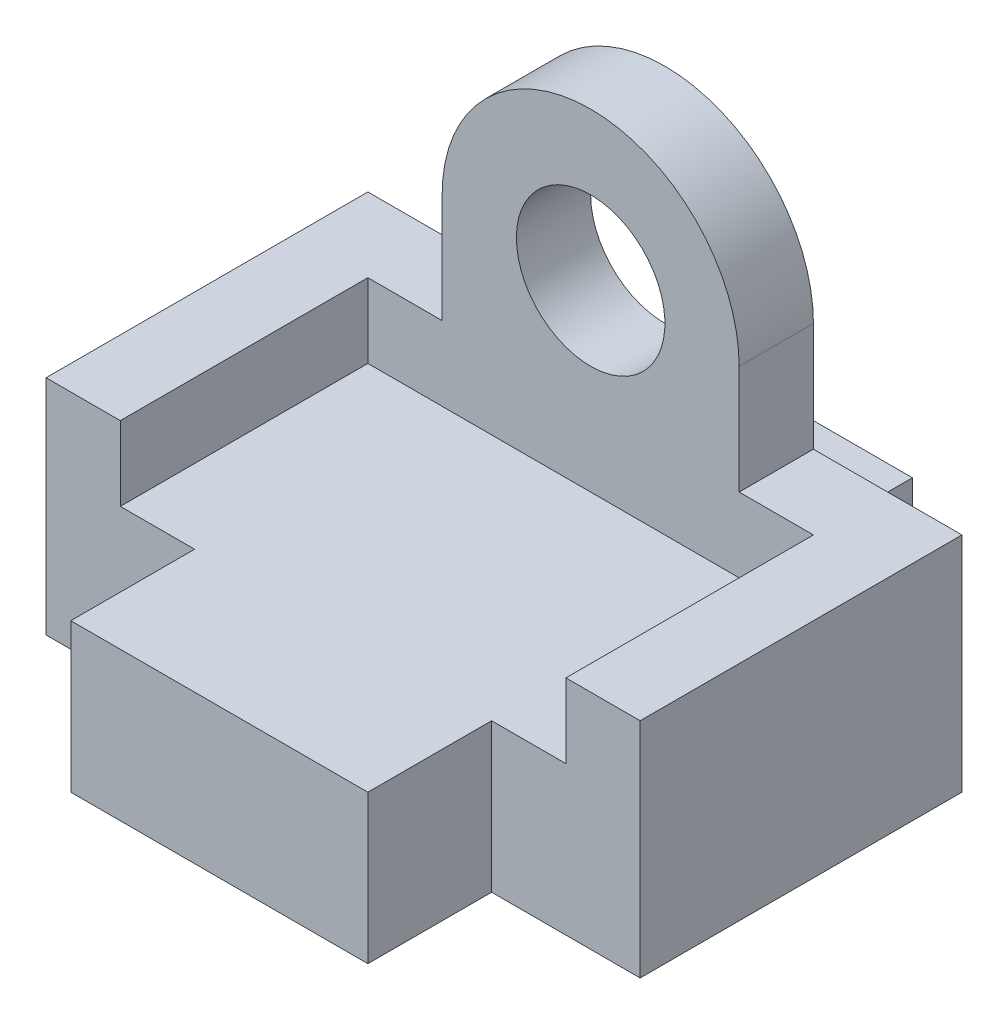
ISO-10303-21;
HEADER;
FILE_DESCRIPTION(('STEP AP214'),'2;1');
FILE_NAME('part.step','',(''),(''),'','','');
FILE_SCHEMA(('AUTOMOTIVE_DESIGN { 1 0 10303 214 1 1 1 1 }'));
ENDSEC;
DATA;
#1=APPLICATION_CONTEXT('core data for automotive mechanical design processes');
#2=APPLICATION_PROTOCOL_DEFINITION('international standard','automotive_design',2000,#1);
#3=PRODUCT_CONTEXT('',#1,'mechanical');
#4=PRODUCT('Part','Part','',(#3));
#5=PRODUCT_RELATED_PRODUCT_CATEGORY('part','',(#4));
#6=PRODUCT_DEFINITION_FORMATION('','',#4);
#7=PRODUCT_DEFINITION_CONTEXT('part definition',#1,'design');
#8=PRODUCT_DEFINITION('design','',#6,#7);
#9=PRODUCT_DEFINITION_SHAPE('','',#8);
#10=(LENGTH_UNIT() NAMED_UNIT(*) SI_UNIT(.MILLI.,.METRE.));
#11=(NAMED_UNIT(*) PLANE_ANGLE_UNIT() SI_UNIT($,.RADIAN.));
#12=(NAMED_UNIT(*) SI_UNIT($,.STERADIAN.) SOLID_ANGLE_UNIT());
#13=UNCERTAINTY_MEASURE_WITH_UNIT(LENGTH_MEASURE(1.E-05),#10,'distance_accuracy_value','');
#14=(GEOMETRIC_REPRESENTATION_CONTEXT(3) GLOBAL_UNCERTAINTY_ASSIGNED_CONTEXT((#13)) GLOBAL_UNIT_ASSIGNED_CONTEXT((#10,
#11,#12)) REPRESENTATION_CONTEXT('',''));
#15=CARTESIAN_POINT('',(0.,0.,0.));
#16=DIRECTION('',(0.,0.,1.));
#17=DIRECTION('',(1.,0.,0.));
#18=AXIS2_PLACEMENT_3D('',#15,#16,#17);
#19=CARTESIAN_POINT('',(-106.292846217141,45.,32.5));
#20=DIRECTION('',(0.,1.,0.));
#21=DIRECTION('',(0.,0.,1.));
#22=AXIS2_PLACEMENT_3D('',#19,#20,#21);
#23=PLANE('',#22);
#24=DIRECTION('',(1.,0.,0.));
#25=VECTOR('',#24,1.);
#26=CARTESIAN_POINT('',(-106.292846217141,45.,15.));
#27=LINE('',#26,#25);
#28=CARTESIAN_POINT('',(-45.,45.,15.));
#29=VERTEX_POINT('',#28);
#30=CARTESIAN_POINT('',(-30.,45.,15.));
#31=VERTEX_POINT('',#30);
#32=EDGE_CURVE('E330',#29,#31,#27,.T.);
#33=ORIENTED_EDGE('',*,*,#32,.T.);
#34=DIRECTION('',(0.,0.,-1.));
#35=VECTOR('',#34,1.);
#36=CARTESIAN_POINT('',(-30.,45.,15.));
#37=LINE('',#36,#35);
#38=CARTESIAN_POINT('',(-30.,45.,0.));
#39=VERTEX_POINT('',#38);
#40=EDGE_CURVE('E228',#31,#39,#37,.T.);
#41=ORIENTED_EDGE('',*,*,#40,.T.);
#42=DIRECTION('',(1.,0.,0.));
#43=VECTOR('',#42,1.);
#44=CARTESIAN_POINT('',(-106.292846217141,45.,0.));
#45=LINE('',#44,#43);
#46=CARTESIAN_POINT('',(-60.,45.,0.));
#47=VERTEX_POINT('',#46);
#48=EDGE_CURVE('E316',#47,#39,#45,.T.);
#49=ORIENTED_EDGE('',*,*,#48,.F.);
#50=DIRECTION('',(0.,0.,1.));
#51=VECTOR('',#50,1.);
#52=CARTESIAN_POINT('',(-60.,45.,32.5));
#53=LINE('',#52,#51);
#54=CARTESIAN_POINT('',(-60.,45.,65.));
#55=VERTEX_POINT('',#54);
#56=EDGE_CURVE('E314',#47,#55,#53,.T.);
#57=ORIENTED_EDGE('',*,*,#56,.T.);
#58=DIRECTION('',(1.,0.,0.));
#59=VECTOR('',#58,1.);
#60=CARTESIAN_POINT('',(-106.292846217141,45.,65.));
#61=LINE('',#60,#59);
#62=CARTESIAN_POINT('',(-45.,45.,65.));
#63=VERTEX_POINT('',#62);
#64=EDGE_CURVE('E312',#55,#63,#61,.T.);
#65=ORIENTED_EDGE('',*,*,#64,.T.);
#66=DIRECTION('',(0.,0.,1.));
#67=VECTOR('',#66,1.);
#68=CARTESIAN_POINT('',(-45.,45.,32.5));
#69=LINE('',#68,#67);
#70=EDGE_CURVE('E299',#29,#63,#69,.T.);
#71=ORIENTED_EDGE('',*,*,#70,.F.);
#72=EDGE_LOOP('',(#33,#41,#49,#57,#65,#71));
#73=FACE_BOUND('',#72,.T.);
#74=ADVANCED_FACE('F30',(#73),#23,.T.);
#75=CARTESIAN_POINT('',(-106.292846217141,30.,65.));
#76=DIRECTION('',(0.,0.,-1.));
#77=DIRECTION('',(-1.,0.,0.));
#78=AXIS2_PLACEMENT_3D('',#75,#76,#77);
#79=PLANE('',#78);
#80=DIRECTION('',(0.,-1.,0.));
#81=VECTOR('',#80,1.);
#82=CARTESIAN_POINT('',(-30.,30.,65.));
#83=LINE('',#82,#81);
#84=CARTESIAN_POINT('',(-30.,30.,65.));
#85=VERTEX_POINT('',#84);
#86=CARTESIAN_POINT('',(-30.,0.,65.));
#87=VERTEX_POINT('',#86);
#88=EDGE_CURVE('E224',#85,#87,#83,.T.);
#89=ORIENTED_EDGE('',*,*,#88,.F.);
#90=DIRECTION('',(1.,0.,0.));
#91=VECTOR('',#90,1.);
#92=CARTESIAN_POINT('',(-106.292846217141,30.,65.));
#93=LINE('',#92,#91);
#94=CARTESIAN_POINT('',(-45.,30.,65.));
#95=VERTEX_POINT('',#94);
#96=EDGE_CURVE('E256',#95,#85,#93,.T.);
#97=ORIENTED_EDGE('',*,*,#96,.F.);
#98=DIRECTION('',(0.,-1.,0.));
#99=VECTOR('',#98,1.);
#100=CARTESIAN_POINT('',(-45.,45.,65.));
#101=LINE('',#100,#99);
#102=EDGE_CURVE('E293',#63,#95,#101,.T.);
#103=ORIENTED_EDGE('',*,*,#102,.F.);
#104=ORIENTED_EDGE('',*,*,#64,.F.);
#105=DIRECTION('',(0.,-1.,0.));
#106=VECTOR('',#105,1.);
#107=CARTESIAN_POINT('',(-60.,45.,65.));
#108=LINE('',#107,#106);
#109=CARTESIAN_POINT('',(-60.,0.,65.));
#110=VERTEX_POINT('',#109);
#111=EDGE_CURVE('E290',#55,#110,#108,.T.);
#112=ORIENTED_EDGE('',*,*,#111,.T.);
#113=DIRECTION('',(1.,0.,0.));
#114=VECTOR('',#113,1.);
#115=CARTESIAN_POINT('',(-106.292846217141,0.,65.));
#116=LINE('',#115,#114);
#117=EDGE_CURVE('E250',#110,#87,#116,.T.);
#118=ORIENTED_EDGE('',*,*,#117,.T.);
#119=EDGE_LOOP('',(#89,#97,#103,#104,#112,#118));
#120=FACE_BOUND('',#119,.T.);
#121=ADVANCED_FACE('F32',(#120),#79,.F.);
#122=DIRECTION('',(0.,1.,0.));
#123=VECTOR('',#122,1.);
#124=CARTESIAN_POINT('',(30.,30.,65.));
#125=LINE('',#124,#123);
#126=CARTESIAN_POINT('',(30.,0.,65.));
#127=VERTEX_POINT('',#126);
#128=CARTESIAN_POINT('',(30.,30.,65.));
#129=VERTEX_POINT('',#128);
#130=EDGE_CURVE('E396',#127,#129,#125,.T.);
#131=ORIENTED_EDGE('',*,*,#130,.F.);
#132=CARTESIAN_POINT('',(60.,0.,65.));
#133=VERTEX_POINT('',#132);
#134=EDGE_CURVE('E253',#127,#133,#116,.T.);
#135=ORIENTED_EDGE('',*,*,#134,.T.);
#136=DIRECTION('',(0.,-1.,0.));
#137=VECTOR('',#136,1.);
#138=CARTESIAN_POINT('',(60.,45.,65.));
#139=LINE('',#138,#137);
#140=CARTESIAN_POINT('',(60.,45.,65.));
#141=VERTEX_POINT('',#140);
#142=EDGE_CURVE('E281',#141,#133,#139,.T.);
#143=ORIENTED_EDGE('',*,*,#142,.F.);
#144=DIRECTION('',(1.,0.,0.));
#145=VECTOR('',#144,1.);
#146=CARTESIAN_POINT('',(-106.292846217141,45.,65.));
#147=LINE('',#146,#145);
#148=CARTESIAN_POINT('',(45.,45.,65.));
#149=VERTEX_POINT('',#148);
#150=EDGE_CURVE('E280',#149,#141,#147,.T.);
#151=ORIENTED_EDGE('',*,*,#150,.F.);
#152=DIRECTION('',(0.,-1.,0.));
#153=VECTOR('',#152,1.);
#154=CARTESIAN_POINT('',(45.,45.,65.));
#155=LINE('',#154,#153);
#156=CARTESIAN_POINT('',(45.,30.,65.));
#157=VERTEX_POINT('',#156);
#158=EDGE_CURVE('E273',#149,#157,#155,.T.);
#159=ORIENTED_EDGE('',*,*,#158,.T.);
#160=EDGE_CURVE('E259',#129,#157,#93,.T.);
#161=ORIENTED_EDGE('',*,*,#160,.F.);
#162=EDGE_LOOP('',(#131,#135,#143,#151,#159,#161));
#163=FACE_BOUND('',#162,.T.);
#164=ADVANCED_FACE('F277',(#163),#79,.F.);
#165=CARTESIAN_POINT('',(-106.292846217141,30.,32.5));
#166=DIRECTION('',(0.,1.,0.));
#167=DIRECTION('',(0.,0.,1.));
#168=AXIS2_PLACEMENT_3D('',#165,#166,#167);
#169=PLANE('',#168);
#170=DIRECTION('',(0.,0.,-1.));
#171=VECTOR('',#170,1.);
#172=CARTESIAN_POINT('',(30.,30.,90.));
#173=LINE('',#172,#171);
#174=CARTESIAN_POINT('',(30.,30.,90.));
#175=VERTEX_POINT('',#174);
#176=EDGE_CURVE('E410',#175,#129,#173,.T.);
#177=ORIENTED_EDGE('',*,*,#176,.T.);
#178=ORIENTED_EDGE('',*,*,#160,.T.);
#179=DIRECTION('',(0.,0.,1.));
#180=VECTOR('',#179,1.);
#181=CARTESIAN_POINT('',(45.,30.,32.5));
#182=LINE('',#181,#180);
#183=CARTESIAN_POINT('',(45.,30.,15.));
#184=VERTEX_POINT('',#183);
#185=EDGE_CURVE('E244',#184,#157,#182,.T.);
#186=ORIENTED_EDGE('',*,*,#185,.F.);
#187=DIRECTION('',(1.,0.,0.));
#188=VECTOR('',#187,1.);
#189=CARTESIAN_POINT('',(-106.292846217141,30.,15.));
#190=LINE('',#189,#188);
#191=CARTESIAN_POINT('',(-45.,30.,15.));
#192=VERTEX_POINT('',#191);
#193=EDGE_CURVE('E238',#192,#184,#190,.T.);
#194=ORIENTED_EDGE('',*,*,#193,.F.);
#195=DIRECTION('',(0.,0.,1.));
#196=VECTOR('',#195,1.);
#197=CARTESIAN_POINT('',(-45.,30.,32.5));
#198=LINE('',#197,#196);
#199=EDGE_CURVE('E234',#192,#95,#198,.T.);
#200=ORIENTED_EDGE('',*,*,#199,.T.);
#201=ORIENTED_EDGE('',*,*,#96,.T.);
#202=DIRECTION('',(0.,0.,-1.));
#203=VECTOR('',#202,1.);
#204=CARTESIAN_POINT('',(-30.,30.,90.));
#205=LINE('',#204,#203);
#206=CARTESIAN_POINT('',(-30.,30.,90.));
#207=VERTEX_POINT('',#206);
#208=EDGE_CURVE('E401',#207,#85,#205,.T.);
#209=ORIENTED_EDGE('',*,*,#208,.F.);
#210=DIRECTION('',(-1.,0.,0.));
#211=VECTOR('',#210,1.);
#212=CARTESIAN_POINT('',(-30.,30.,90.));
#213=LINE('',#212,#211);
#214=EDGE_CURVE('E400',#175,#207,#213,.T.);
#215=ORIENTED_EDGE('',*,*,#214,.F.);
#216=EDGE_LOOP('',(#177,#178,#186,#194,#200,#201,#209,#215));
#217=FACE_BOUND('',#216,.T.);
#218=ADVANCED_FACE('F428',(#217),#169,.T.);
#219=CARTESIAN_POINT('',(-106.292846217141,0.,32.5));
#220=DIRECTION('',(0.,1.,0.));
#221=DIRECTION('',(0.,0.,1.));
#222=AXIS2_PLACEMENT_3D('',#219,#220,#221);
#223=PLANE('',#222);
#224=DIRECTION('',(0.,0.,-1.));
#225=VECTOR('',#224,1.);
#226=CARTESIAN_POINT('',(-30.,0.,90.));
#227=LINE('',#226,#225);
#228=CARTESIAN_POINT('',(-30.,0.,90.));
#229=VERTEX_POINT('',#228);
#230=EDGE_CURVE('E309',#229,#87,#227,.T.);
#231=ORIENTED_EDGE('',*,*,#230,.T.);
#232=ORIENTED_EDGE('',*,*,#117,.F.);
#233=DIRECTION('',(0.,0.,1.));
#234=VECTOR('',#233,1.);
#235=CARTESIAN_POINT('',(-60.,0.,32.5));
#236=LINE('',#235,#234);
#237=CARTESIAN_POINT('',(-60.,0.,0.));
#238=VERTEX_POINT('',#237);
#239=EDGE_CURVE('E300',#238,#110,#236,.T.);
#240=ORIENTED_EDGE('',*,*,#239,.F.);
#241=DIRECTION('',(1.,0.,0.));
#242=VECTOR('',#241,1.);
#243=CARTESIAN_POINT('',(-106.292846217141,0.,0.));
#244=LINE('',#243,#242);
#245=CARTESIAN_POINT('',(-30.,0.,0.));
#246=VERTEX_POINT('',#245);
#247=EDGE_CURVE('E171',#238,#246,#244,.T.);
#248=ORIENTED_EDGE('',*,*,#247,.T.);
#249=DIRECTION('',(0.,0.,1.));
#250=VECTOR('',#249,1.);
#251=CARTESIAN_POINT('',(-30.,0.,-20.));
#252=LINE('',#251,#250);
#253=CARTESIAN_POINT('',(-30.,0.,-20.));
#254=VERTEX_POINT('',#253);
#255=EDGE_CURVE('E164',#254,#246,#252,.T.);
#256=ORIENTED_EDGE('',*,*,#255,.F.);
#257=DIRECTION('',(1.,0.,0.));
#258=VECTOR('',#257,1.);
#259=CARTESIAN_POINT('',(-30.,0.,-20.));
#260=LINE('',#259,#258);
#261=CARTESIAN_POINT('',(30.,0.,-20.));
#262=VERTEX_POINT('',#261);
#263=EDGE_CURVE('E168',#254,#262,#260,.T.);
#264=ORIENTED_EDGE('',*,*,#263,.T.);
#265=DIRECTION('',(0.,0.,1.));
#266=VECTOR('',#265,1.);
#267=CARTESIAN_POINT('',(30.,0.,-20.));
#268=LINE('',#267,#266);
#269=CARTESIAN_POINT('',(30.,0.,0.));
#270=VERTEX_POINT('',#269);
#271=EDGE_CURVE('E45',#262,#270,#268,.T.);
#272=ORIENTED_EDGE('',*,*,#271,.T.);
#273=CARTESIAN_POINT('',(60.,0.,0.));
#274=VERTEX_POINT('',#273);
#275=EDGE_CURVE('E305',#270,#274,#244,.T.);
#276=ORIENTED_EDGE('',*,*,#275,.T.);
#277=DIRECTION('',(0.,0.,1.));
#278=VECTOR('',#277,1.);
#279=CARTESIAN_POINT('',(60.,0.,32.5));
#280=LINE('',#279,#278);
#281=EDGE_CURVE('E306',#274,#133,#280,.T.);
#282=ORIENTED_EDGE('',*,*,#281,.T.);
#283=ORIENTED_EDGE('',*,*,#134,.F.);
#284=DIRECTION('',(0.,0.,-1.));
#285=VECTOR('',#284,1.);
#286=CARTESIAN_POINT('',(30.,0.,90.));
#287=LINE('',#286,#285);
#288=CARTESIAN_POINT('',(30.,0.,90.));
#289=VERTEX_POINT('',#288);
#290=EDGE_CURVE('E415',#289,#127,#287,.T.);
#291=ORIENTED_EDGE('',*,*,#290,.F.);
#292=DIRECTION('',(1.,0.,0.));
#293=VECTOR('',#292,1.);
#294=CARTESIAN_POINT('',(-30.,0.,90.));
#295=LINE('',#294,#293);
#296=EDGE_CURVE('E395',#229,#289,#295,.T.);
#297=ORIENTED_EDGE('',*,*,#296,.F.);
#298=EDGE_LOOP('',(#231,#232,#240,#248,#256,#264,#272,#276,#282,#283,#291,#297));
#299=FACE_BOUND('',#298,.T.);
#300=ADVANCED_FACE('F167',(#299),#223,.F.);
#301=CARTESIAN_POINT('',(-106.292846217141,45.,15.));
#302=DIRECTION('',(0.,0.,-1.));
#303=DIRECTION('',(-1.,0.,0.));
#304=AXIS2_PLACEMENT_3D('',#301,#302,#303);
#305=PLANE('',#304);
#306=ORIENTED_EDGE('',*,*,#193,.T.);
#307=DIRECTION('',(0.,-1.,0.));
#308=VECTOR('',#307,1.);
#309=CARTESIAN_POINT('',(45.,45.,15.));
#310=LINE('',#309,#308);
#311=CARTESIAN_POINT('',(45.,45.,15.));
#312=VERTEX_POINT('',#311);
#313=EDGE_CURVE('E255',#312,#184,#310,.T.);
#314=ORIENTED_EDGE('',*,*,#313,.F.);
#315=CARTESIAN_POINT('',(30.,45.,15.));
#316=VERTEX_POINT('',#315);
#317=EDGE_CURVE('E303',#316,#312,#27,.T.);
#318=ORIENTED_EDGE('',*,*,#317,.F.);
#319=DIRECTION('',(0.,-1.,0.));
#320=VECTOR('',#319,1.);
#321=CARTESIAN_POINT('',(30.,45.,15.));
#322=LINE('',#321,#320);
#323=CARTESIAN_POINT('',(30.,67.,15.));
#324=VERTEX_POINT('',#323);
#325=EDGE_CURVE('E210',#324,#316,#322,.T.);
#326=ORIENTED_EDGE('',*,*,#325,.F.);
#327=CARTESIAN_POINT('',(0.,67.,15.));
#328=DIRECTION('',(0.,0.,-1.));
#329=DIRECTION('',(1.,0.,0.));
#330=AXIS2_PLACEMENT_3D('',#327,#328,#329);
#331=CIRCLE('',#330,30.);
#332=CARTESIAN_POINT('',(-30.,67.,15.));
#333=VERTEX_POINT('',#332);
#334=EDGE_CURVE('E207',#333,#324,#331,.T.);
#335=ORIENTED_EDGE('',*,*,#334,.F.);
#336=DIRECTION('',(0.,1.,0.));
#337=VECTOR('',#336,1.);
#338=CARTESIAN_POINT('',(-30.,67.,15.));
#339=LINE('',#338,#337);
#340=EDGE_CURVE('E211',#31,#333,#339,.T.);
#341=ORIENTED_EDGE('',*,*,#340,.F.);
#342=ORIENTED_EDGE('',*,*,#32,.F.);
#343=DIRECTION('',(0.,-1.,0.));
#344=VECTOR('',#343,1.);
#345=CARTESIAN_POINT('',(-45.,45.,15.));
#346=LINE('',#345,#344);
#347=EDGE_CURVE('E296',#29,#192,#346,.T.);
#348=ORIENTED_EDGE('',*,*,#347,.T.);
#349=EDGE_LOOP('',(#306,#314,#318,#326,#335,#341,#342,#348));
#350=FACE_BOUND('',#349,.T.);
#351=CARTESIAN_POINT('',(0.,67.,15.));
#352=DIRECTION('',(0.,0.,-1.));
#353=DIRECTION('',(-1.,0.,0.));
#354=AXIS2_PLACEMENT_3D('',#351,#352,#353);
#355=CIRCLE('',#354,15.);
#356=CARTESIAN_POINT('',(-15.,67.,15.));
#357=VERTEX_POINT('',#356);
#358=EDGE_CURVE('E202',#357,#357,#355,.T.);
#359=ORIENTED_EDGE('',*,*,#358,.T.);
#360=EDGE_LOOP('',(#359));
#361=FACE_BOUND('',#360,.T.);
#362=ADVANCED_FACE('F380',(#350,#361),#305,.F.);
#363=CARTESIAN_POINT('',(45.,45.,32.5));
#364=DIRECTION('',(1.,0.,0.));
#365=DIRECTION('',(0.,0.,-1.));
#366=AXIS2_PLACEMENT_3D('',#363,#364,#365);
#367=PLANE('',#366);
#368=ORIENTED_EDGE('',*,*,#185,.T.);
#369=ORIENTED_EDGE('',*,*,#158,.F.);
#370=DIRECTION('',(0.,0.,1.));
#371=VECTOR('',#370,1.);
#372=CARTESIAN_POINT('',(45.,45.,32.5));
#373=LINE('',#372,#371);
#374=EDGE_CURVE('E337',#312,#149,#373,.T.);
#375=ORIENTED_EDGE('',*,*,#374,.F.);
#376=ORIENTED_EDGE('',*,*,#313,.T.);
#377=EDGE_LOOP('',(#368,#369,#375,#376));
#378=FACE_BOUND('',#377,.T.);
#379=ADVANCED_FACE('F271',(#378),#367,.F.);
#380=CARTESIAN_POINT('',(60.,45.,32.5));
#381=DIRECTION('',(1.,0.,0.));
#382=DIRECTION('',(0.,0.,-1.));
#383=AXIS2_PLACEMENT_3D('',#380,#381,#382);
#384=PLANE('',#383);
#385=ORIENTED_EDGE('',*,*,#281,.F.);
#386=DIRECTION('',(0.,-1.,0.));
#387=VECTOR('',#386,1.);
#388=CARTESIAN_POINT('',(60.,45.,0.));
#389=LINE('',#388,#387);
#390=CARTESIAN_POINT('',(60.,45.,0.));
#391=VERTEX_POINT('',#390);
#392=EDGE_CURVE('E283',#391,#274,#389,.T.);
#393=ORIENTED_EDGE('',*,*,#392,.F.);
#394=DIRECTION('',(0.,0.,1.));
#395=VECTOR('',#394,1.);
#396=CARTESIAN_POINT('',(60.,45.,32.5));
#397=LINE('',#396,#395);
#398=EDGE_CURVE('E319',#391,#141,#397,.T.);
#399=ORIENTED_EDGE('',*,*,#398,.T.);
#400=ORIENTED_EDGE('',*,*,#142,.T.);
#401=EDGE_LOOP('',(#385,#393,#399,#400));
#402=FACE_BOUND('',#401,.T.);
#403=ADVANCED_FACE('F351',(#402),#384,.T.);
#404=CARTESIAN_POINT('',(-106.292846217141,45.,0.));
#405=DIRECTION('',(0.,0.,-1.));
#406=DIRECTION('',(-1.,0.,0.));
#407=AXIS2_PLACEMENT_3D('',#404,#405,#406);
#408=PLANE('',#407);
#409=DIRECTION('',(0.,1.,0.));
#410=VECTOR('',#409,1.);
#411=CARTESIAN_POINT('',(-30.,45.,0.));
#412=LINE('',#411,#410);
#413=CARTESIAN_POINT('',(-30.,30.,0.));
#414=VERTEX_POINT('',#413);
#415=EDGE_CURVE('E11',#246,#414,#412,.T.);
#416=ORIENTED_EDGE('',*,*,#415,.F.);
#417=ORIENTED_EDGE('',*,*,#247,.F.);
#418=DIRECTION('',(0.,-1.,0.));
#419=VECTOR('',#418,1.);
#420=CARTESIAN_POINT('',(-60.,45.,0.));
#421=LINE('',#420,#419);
#422=EDGE_CURVE('E288',#47,#238,#421,.T.);
#423=ORIENTED_EDGE('',*,*,#422,.F.);
#424=ORIENTED_EDGE('',*,*,#48,.T.);
#425=DIRECTION('',(0.,1.,0.));
#426=VECTOR('',#425,1.);
#427=CARTESIAN_POINT('',(-30.,67.,0.));
#428=LINE('',#427,#426);
#429=CARTESIAN_POINT('',(-30.,67.,0.));
#430=VERTEX_POINT('',#429);
#431=EDGE_CURVE('E53',#39,#430,#428,.T.);
#432=ORIENTED_EDGE('',*,*,#431,.T.);
#433=CARTESIAN_POINT('',(0.,67.,0.));
#434=DIRECTION('',(0.,0.,-1.));
#435=DIRECTION('',(1.,0.,0.));
#436=AXIS2_PLACEMENT_3D('',#433,#434,#435);
#437=CIRCLE('',#436,30.);
#438=CARTESIAN_POINT('',(30.,67.,0.));
#439=VERTEX_POINT('',#438);
#440=EDGE_CURVE('E212',#430,#439,#437,.T.);
#441=ORIENTED_EDGE('',*,*,#440,.T.);
#442=DIRECTION('',(0.,-1.,0.));
#443=VECTOR('',#442,1.);
#444=CARTESIAN_POINT('',(30.,45.,0.));
#445=LINE('',#444,#443);
#446=CARTESIAN_POINT('',(30.,45.,0.));
#447=VERTEX_POINT('',#446);
#448=EDGE_CURVE('E215',#439,#447,#445,.T.);
#449=ORIENTED_EDGE('',*,*,#448,.T.);
#450=EDGE_CURVE('E323',#447,#391,#45,.T.);
#451=ORIENTED_EDGE('',*,*,#450,.T.);
#452=ORIENTED_EDGE('',*,*,#392,.T.);
#453=ORIENTED_EDGE('',*,*,#275,.F.);
#454=DIRECTION('',(0.,-1.,0.));
#455=VECTOR('',#454,1.);
#456=CARTESIAN_POINT('',(30.,45.,0.));
#457=LINE('',#456,#455);
#458=CARTESIAN_POINT('',(30.,30.,0.));
#459=VERTEX_POINT('',#458);
#460=EDGE_CURVE('E38',#459,#270,#457,.T.);
#461=ORIENTED_EDGE('',*,*,#460,.F.);
#462=DIRECTION('',(1.,0.,0.));
#463=VECTOR('',#462,1.);
#464=CARTESIAN_POINT('',(-106.292846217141,30.,0.));
#465=LINE('',#464,#463);
#466=EDGE_CURVE('E195',#414,#459,#465,.T.);
#467=ORIENTED_EDGE('',*,*,#466,.F.);
#468=EDGE_LOOP('',(#416,#417,#423,#424,#432,#441,#449,#451,#452,#453,#461,#467));
#469=FACE_BOUND('',#468,.T.);
#470=CARTESIAN_POINT('',(0.,67.,0.));
#471=DIRECTION('',(0.,0.,-1.));
#472=DIRECTION('',(-1.,0.,0.));
#473=AXIS2_PLACEMENT_3D('',#470,#471,#472);
#474=CIRCLE('',#473,15.);
#475=CARTESIAN_POINT('',(-15.,67.,0.));
#476=VERTEX_POINT('',#475);
#477=EDGE_CURVE('E201',#476,#476,#474,.T.);
#478=ORIENTED_EDGE('',*,*,#477,.F.);
#479=EDGE_LOOP('',(#478));
#480=FACE_BOUND('',#479,.T.);
#481=ADVANCED_FACE('F346',(#469,#480),#408,.T.);
#482=CARTESIAN_POINT('',(-60.,45.,32.5));
#483=DIRECTION('',(1.,0.,0.));
#484=DIRECTION('',(0.,0.,-1.));
#485=AXIS2_PLACEMENT_3D('',#482,#483,#484);
#486=PLANE('',#485);
#487=ORIENTED_EDGE('',*,*,#239,.T.);
#488=ORIENTED_EDGE('',*,*,#111,.F.);
#489=ORIENTED_EDGE('',*,*,#56,.F.);
#490=ORIENTED_EDGE('',*,*,#422,.T.);
#491=EDGE_LOOP('',(#487,#488,#489,#490));
#492=FACE_BOUND('',#491,.T.);
#493=ADVANCED_FACE('F365',(#492),#486,.F.);
#494=CARTESIAN_POINT('',(-45.,45.,32.5));
#495=DIRECTION('',(1.,0.,0.));
#496=DIRECTION('',(0.,0.,-1.));
#497=AXIS2_PLACEMENT_3D('',#494,#495,#496);
#498=PLANE('',#497);
#499=ORIENTED_EDGE('',*,*,#102,.T.);
#500=ORIENTED_EDGE('',*,*,#199,.F.);
#501=ORIENTED_EDGE('',*,*,#347,.F.);
#502=ORIENTED_EDGE('',*,*,#70,.T.);
#503=EDGE_LOOP('',(#499,#500,#501,#502));
#504=FACE_BOUND('',#503,.T.);
#505=ADVANCED_FACE('F356',(#504),#498,.T.);
#506=DIRECTION('',(0.,0.,-1.));
#507=VECTOR('',#506,1.);
#508=CARTESIAN_POINT('',(30.,45.,15.));
#509=LINE('',#508,#507);
#510=EDGE_CURVE('E221',#316,#447,#509,.T.);
#511=ORIENTED_EDGE('',*,*,#510,.F.);
#512=ORIENTED_EDGE('',*,*,#317,.T.);
#513=ORIENTED_EDGE('',*,*,#374,.T.);
#514=ORIENTED_EDGE('',*,*,#150,.T.);
#515=ORIENTED_EDGE('',*,*,#398,.F.);
#516=ORIENTED_EDGE('',*,*,#450,.F.);
#517=EDGE_LOOP('',(#511,#512,#513,#514,#515,#516));
#518=FACE_BOUND('',#517,.T.);
#519=ADVANCED_FACE('F352',(#518),#23,.T.);
#520=CARTESIAN_POINT('',(-30.,30.,90.));
#521=DIRECTION('',(1.,0.,0.));
#522=DIRECTION('',(0.,1.,0.));
#523=AXIS2_PLACEMENT_3D('',#520,#521,#522);
#524=PLANE('',#523);
#525=ORIENTED_EDGE('',*,*,#88,.T.);
#526=ORIENTED_EDGE('',*,*,#230,.F.);
#527=DIRECTION('',(0.,-1.,0.));
#528=VECTOR('',#527,1.);
#529=CARTESIAN_POINT('',(-30.,30.,90.));
#530=LINE('',#529,#528);
#531=EDGE_CURVE('E392',#207,#229,#530,.T.);
#532=ORIENTED_EDGE('',*,*,#531,.F.);
#533=ORIENTED_EDGE('',*,*,#208,.T.);
#534=EDGE_LOOP('',(#525,#526,#532,#533));
#535=FACE_BOUND('',#534,.T.);
#536=ADVANCED_FACE('F355',(#535),#524,.F.);
#537=CARTESIAN_POINT('',(30.,30.,90.));
#538=DIRECTION('',(-1.,0.,0.));
#539=DIRECTION('',(0.,-1.,0.));
#540=AXIS2_PLACEMENT_3D('',#537,#538,#539);
#541=PLANE('',#540);
#542=ORIENTED_EDGE('',*,*,#130,.T.);
#543=ORIENTED_EDGE('',*,*,#176,.F.);
#544=DIRECTION('',(0.,1.,0.));
#545=VECTOR('',#544,1.);
#546=CARTESIAN_POINT('',(30.,30.,90.));
#547=LINE('',#546,#545);
#548=EDGE_CURVE('E398',#289,#175,#547,.T.);
#549=ORIENTED_EDGE('',*,*,#548,.F.);
#550=ORIENTED_EDGE('',*,*,#290,.T.);
#551=EDGE_LOOP('',(#542,#543,#549,#550));
#552=FACE_BOUND('',#551,.T.);
#553=ADVANCED_FACE('F362',(#552),#541,.F.);
#554=CARTESIAN_POINT('',(-30.,30.,90.));
#555=DIRECTION('',(0.,0.,1.));
#556=DIRECTION('',(1.,0.,0.));
#557=AXIS2_PLACEMENT_3D('',#554,#555,#556);
#558=PLANE('',#557);
#559=ORIENTED_EDGE('',*,*,#531,.T.);
#560=ORIENTED_EDGE('',*,*,#296,.T.);
#561=ORIENTED_EDGE('',*,*,#548,.T.);
#562=ORIENTED_EDGE('',*,*,#214,.T.);
#563=EDGE_LOOP('',(#559,#560,#561,#562));
#564=FACE_BOUND('',#563,.T.);
#565=ADVANCED_FACE('F430',(#564),#558,.T.);
#566=CARTESIAN_POINT('',(30.,45.,15.));
#567=DIRECTION('',(1.,0.,0.));
#568=DIRECTION('',(0.,1.,0.));
#569=AXIS2_PLACEMENT_3D('',#566,#567,#568);
#570=PLANE('',#569);
#571=ORIENTED_EDGE('',*,*,#448,.F.);
#572=DIRECTION('',(0.,0.,-1.));
#573=VECTOR('',#572,1.);
#574=CARTESIAN_POINT('',(30.,67.,15.));
#575=LINE('',#574,#573);
#576=EDGE_CURVE('E218',#324,#439,#575,.T.);
#577=ORIENTED_EDGE('',*,*,#576,.F.);
#578=ORIENTED_EDGE('',*,*,#325,.T.);
#579=ORIENTED_EDGE('',*,*,#510,.T.);
#580=EDGE_LOOP('',(#571,#577,#578,#579));
#581=FACE_BOUND('',#580,.T.);
#582=ADVANCED_FACE('F454',(#581),#570,.T.);
#583=CARTESIAN_POINT('',(0.,67.,15.));
#584=DIRECTION('',(0.,0.,-1.));
#585=DIRECTION('',(-1.,0.,0.));
#586=AXIS2_PLACEMENT_3D('',#583,#584,#585);
#587=CYLINDRICAL_SURFACE('',#586,30.);
#588=ORIENTED_EDGE('',*,*,#440,.F.);
#589=DIRECTION('',(0.,0.,-1.));
#590=VECTOR('',#589,1.);
#591=CARTESIAN_POINT('',(-30.,67.,15.));
#592=LINE('',#591,#590);
#593=EDGE_CURVE('E388',#333,#430,#592,.T.);
#594=ORIENTED_EDGE('',*,*,#593,.F.);
#595=ORIENTED_EDGE('',*,*,#334,.T.);
#596=ORIENTED_EDGE('',*,*,#576,.T.);
#597=EDGE_LOOP('',(#588,#594,#595,#596));
#598=FACE_BOUND('',#597,.T.);
#599=ADVANCED_FACE('F457',(#598),#587,.T.);
#600=CARTESIAN_POINT('',(-30.,67.,15.));
#601=DIRECTION('',(-1.,0.,0.));
#602=DIRECTION('',(0.,-1.,0.));
#603=AXIS2_PLACEMENT_3D('',#600,#601,#602);
#604=PLANE('',#603);
#605=ORIENTED_EDGE('',*,*,#431,.F.);
#606=ORIENTED_EDGE('',*,*,#40,.F.);
#607=ORIENTED_EDGE('',*,*,#340,.T.);
#608=ORIENTED_EDGE('',*,*,#593,.T.);
#609=EDGE_LOOP('',(#605,#606,#607,#608));
#610=FACE_BOUND('',#609,.T.);
#611=ADVANCED_FACE('F452',(#610),#604,.T.);
#612=CARTESIAN_POINT('',(0.,67.,15.));
#613=DIRECTION('',(0.,0.,-1.));
#614=DIRECTION('',(-1.,0.,0.));
#615=AXIS2_PLACEMENT_3D('',#612,#613,#614);
#616=CYLINDRICAL_SURFACE('',#615,15.);
#617=ORIENTED_EDGE('',*,*,#358,.F.);
#618=EDGE_LOOP('',(#617));
#619=FACE_BOUND('',#618,.T.);
#620=ORIENTED_EDGE('',*,*,#477,.T.);
#621=EDGE_LOOP('',(#620));
#622=FACE_BOUND('',#621,.T.);
#623=ADVANCED_FACE('F449',(#619,#622),#616,.F.);
#624=CARTESIAN_POINT('',(-30.,30.,-20.));
#625=DIRECTION('',(-1.,0.,0.));
#626=DIRECTION('',(0.,-1.,0.));
#627=AXIS2_PLACEMENT_3D('',#624,#625,#626);
#628=PLANE('',#627);
#629=ORIENTED_EDGE('',*,*,#255,.T.);
#630=ORIENTED_EDGE('',*,*,#415,.T.);
#631=DIRECTION('',(0.,0.,1.));
#632=VECTOR('',#631,1.);
#633=CARTESIAN_POINT('',(-30.,30.,-20.));
#634=LINE('',#633,#632);
#635=CARTESIAN_POINT('',(-30.,30.,-20.));
#636=VERTEX_POINT('',#635);
#637=EDGE_CURVE('E189',#636,#414,#634,.T.);
#638=ORIENTED_EDGE('',*,*,#637,.F.);
#639=DIRECTION('',(0.,-1.,0.));
#640=VECTOR('',#639,1.);
#641=CARTESIAN_POINT('',(-30.,30.,-20.));
#642=LINE('',#641,#640);
#643=EDGE_CURVE('E182',#636,#254,#642,.T.);
#644=ORIENTED_EDGE('',*,*,#643,.T.);
#645=EDGE_LOOP('',(#629,#630,#638,#644));
#646=FACE_BOUND('',#645,.T.);
#647=ADVANCED_FACE('F187',(#646),#628,.T.);
#648=CARTESIAN_POINT('',(-30.,30.,-20.));
#649=DIRECTION('',(0.,1.,0.));
#650=DIRECTION('',(0.,0.,1.));
#651=AXIS2_PLACEMENT_3D('',#648,#649,#650);
#652=PLANE('',#651);
#653=ORIENTED_EDGE('',*,*,#637,.T.);
#654=ORIENTED_EDGE('',*,*,#466,.T.);
#655=DIRECTION('',(0.,0.,1.));
#656=VECTOR('',#655,1.);
#657=CARTESIAN_POINT('',(30.,30.,-20.));
#658=LINE('',#657,#656);
#659=CARTESIAN_POINT('',(30.,30.,-20.));
#660=VERTEX_POINT('',#659);
#661=EDGE_CURVE('E196',#660,#459,#658,.T.);
#662=ORIENTED_EDGE('',*,*,#661,.F.);
#663=DIRECTION('',(-1.,0.,0.));
#664=VECTOR('',#663,1.);
#665=CARTESIAN_POINT('',(-30.,30.,-20.));
#666=LINE('',#665,#664);
#667=EDGE_CURVE('E175',#660,#636,#666,.T.);
#668=ORIENTED_EDGE('',*,*,#667,.T.);
#669=EDGE_LOOP('',(#653,#654,#662,#668));
#670=FACE_BOUND('',#669,.T.);
#671=ADVANCED_FACE('F436',(#670),#652,.T.);
#672=CARTESIAN_POINT('',(30.,30.,-20.));
#673=DIRECTION('',(1.,0.,0.));
#674=DIRECTION('',(0.,1.,0.));
#675=AXIS2_PLACEMENT_3D('',#672,#673,#674);
#676=PLANE('',#675);
#677=ORIENTED_EDGE('',*,*,#661,.T.);
#678=ORIENTED_EDGE('',*,*,#460,.T.);
#679=ORIENTED_EDGE('',*,*,#271,.F.);
#680=DIRECTION('',(0.,1.,0.));
#681=VECTOR('',#680,1.);
#682=CARTESIAN_POINT('',(30.,30.,-20.));
#683=LINE('',#682,#681);
#684=EDGE_CURVE('E185',#262,#660,#683,.T.);
#685=ORIENTED_EDGE('',*,*,#684,.T.);
#686=EDGE_LOOP('',(#677,#678,#679,#685));
#687=FACE_BOUND('',#686,.T.);
#688=ADVANCED_FACE('F437',(#687),#676,.T.);
#689=CARTESIAN_POINT('',(-30.,30.,-20.));
#690=DIRECTION('',(0.,0.,1.));
#691=DIRECTION('',(1.,0.,0.));
#692=AXIS2_PLACEMENT_3D('',#689,#690,#691);
#693=PLANE('',#692);
#694=ORIENTED_EDGE('',*,*,#643,.F.);
#695=ORIENTED_EDGE('',*,*,#667,.F.);
#696=ORIENTED_EDGE('',*,*,#684,.F.);
#697=ORIENTED_EDGE('',*,*,#263,.F.);
#698=EDGE_LOOP('',(#694,#695,#696,#697));
#699=FACE_BOUND('',#698,.T.);
#700=ADVANCED_FACE('F180',(#699),#693,.F.);
#701=CLOSED_SHELL('',(#74,#121,#164,#218,#300,#362,#379,#403,#481,#493,#505,#519,#536,#553,#565,
#582,#599,#611,#623,#647,#671,#688,#700));
#702=MANIFOLD_SOLID_BREP('B2',#701);
#703=ADVANCED_BREP_SHAPE_REPRESENTATION('',(#18,#702),#14);
#704=SHAPE_DEFINITION_REPRESENTATION(#9,#703);
ENDSEC;
END-ISO-10303-21;
